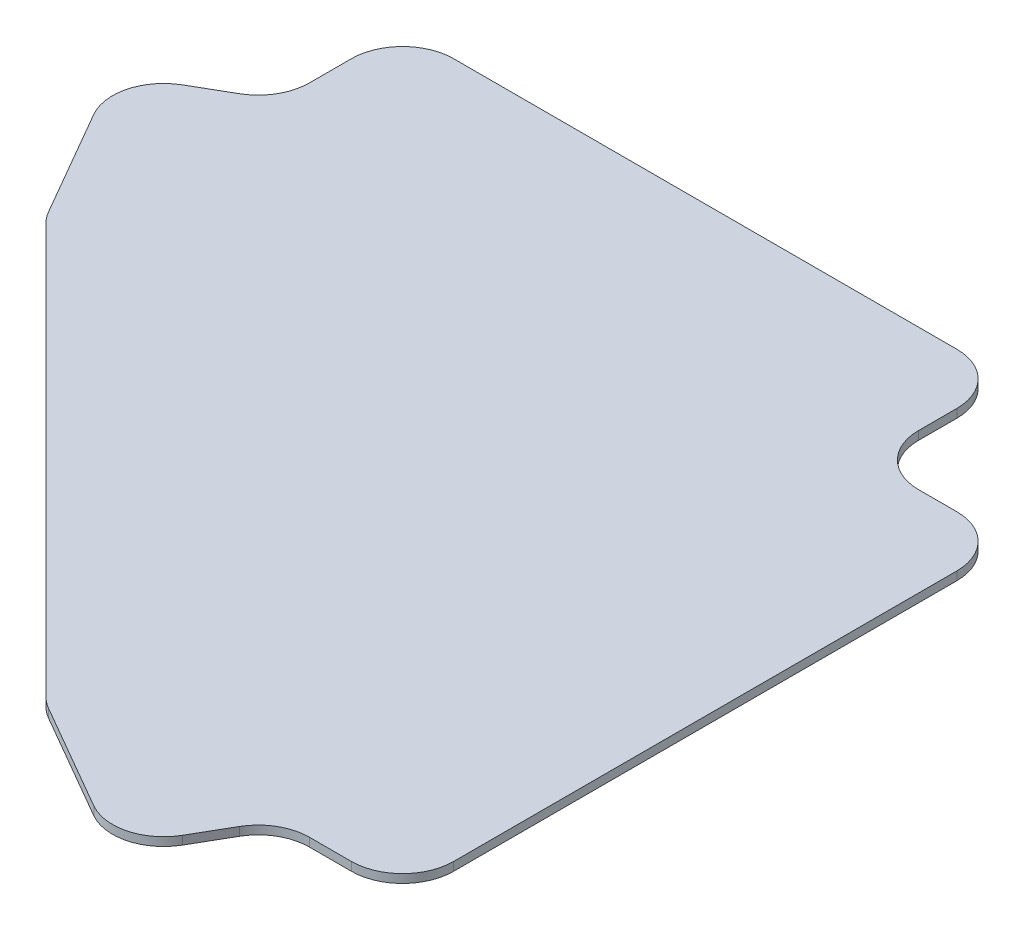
from build123d import *

# Parameters (mm, degrees)
BOSS_EXTRUDE1_DEPTH = 3.175
FILLET1_R           = 19.05


with BuildPart() as part:
    # Sketch1 → Boss-Extrude1 (new body)
    with BuildSketch(Plane(origin=(0, 0, 0), x_dir=(1, 0, 0), z_dir=(0, 1, 0))):
        Polygon((-52.3875, 0), (-277.8125, 0), (-277.8125, -45.629763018), (-317.329033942, -68.444644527), (-283.522083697, -127), (-127, -283.522083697), (-68.444644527, -317.329033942), (-45.629763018, -277.8125), (0, -277.8125), (0, -52.3875), (-52.3875, -52.3875), align=None)
    extrude(amount=BOSS_EXTRUDE1_DEPTH)

    # Fillet1
    fillet1_edges = [part.edges().sort_by_distance(p)[0] for p in [
        (0, 1.5875, 52.3875),
        (0, 1.5875, 277.8125),
        (-45.629763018, 1.5875, 277.8125),
        (-68.444644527, 1.5875, 317.329033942),
        (-127, 1.5875, 283.522083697),
        (-283.522083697, 1.5875, 127),
        (-317.329033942, 1.5875, 68.444644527),
        (-277.8125, 1.5875, 45.629763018),
        (-277.8125, 1.5875, 0),
        (-52.3875, 1.5875, 0),
        (-52.3875, 1.5875, 52.3875),
    ]]
    fillet(fillet1_edges, radius=FILLET1_R)


solid = part.part
